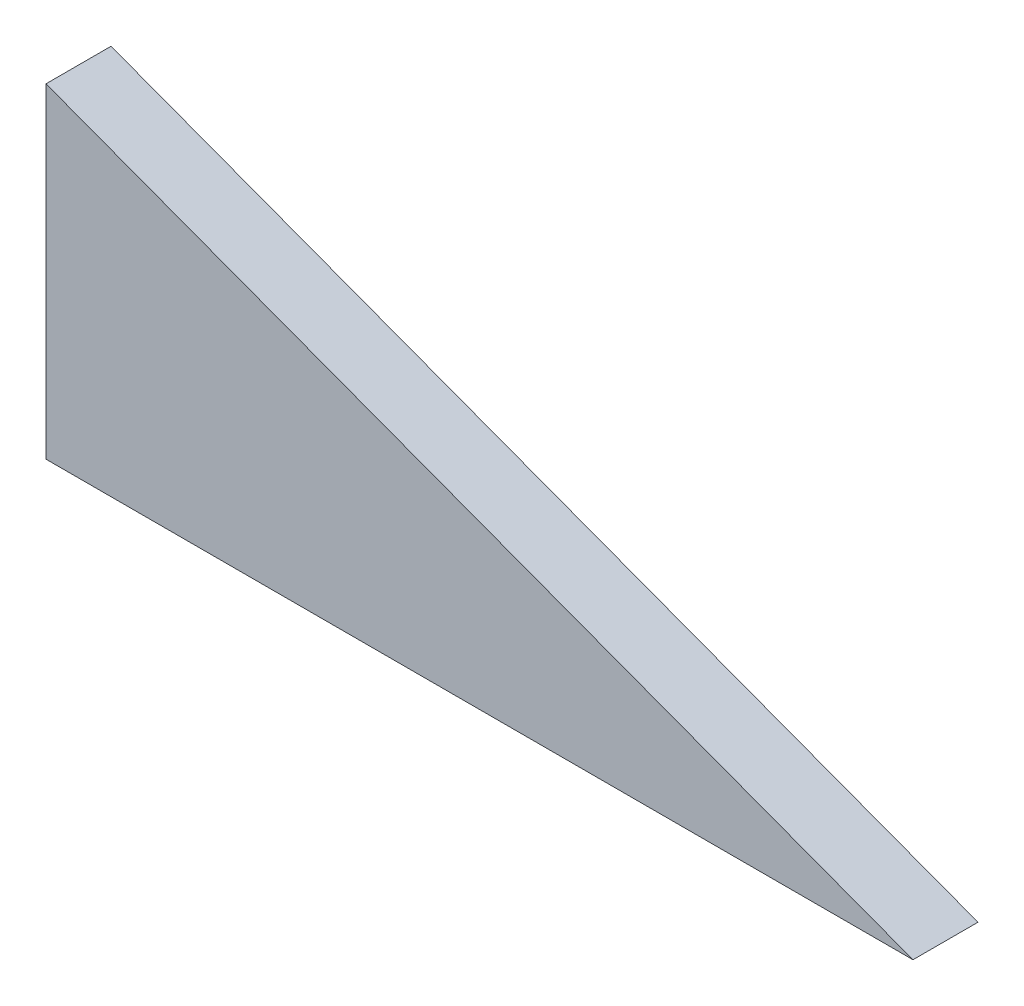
ISO-10303-21;
HEADER;
FILE_DESCRIPTION(('STEP AP214'),'2;1');
FILE_NAME('part.step','',(''),(''),'','','');
FILE_SCHEMA(('AUTOMOTIVE_DESIGN { 1 0 10303 214 1 1 1 1 }'));
ENDSEC;
DATA;
#1=APPLICATION_CONTEXT('core data for automotive mechanical design processes');
#2=APPLICATION_PROTOCOL_DEFINITION('international standard','automotive_design',2000,#1);
#3=PRODUCT_CONTEXT('',#1,'mechanical');
#4=PRODUCT('Part','Part','',(#3));
#5=PRODUCT_RELATED_PRODUCT_CATEGORY('part','',(#4));
#6=PRODUCT_DEFINITION_FORMATION('','',#4);
#7=PRODUCT_DEFINITION_CONTEXT('part definition',#1,'design');
#8=PRODUCT_DEFINITION('design','',#6,#7);
#9=PRODUCT_DEFINITION_SHAPE('','',#8);
#10=(LENGTH_UNIT() NAMED_UNIT(*) SI_UNIT(.MILLI.,.METRE.));
#11=(NAMED_UNIT(*) PLANE_ANGLE_UNIT() SI_UNIT($,.RADIAN.));
#12=(NAMED_UNIT(*) SI_UNIT($,.STERADIAN.) SOLID_ANGLE_UNIT());
#13=UNCERTAINTY_MEASURE_WITH_UNIT(LENGTH_MEASURE(1.E-05),#10,'distance_accuracy_value','');
#14=(GEOMETRIC_REPRESENTATION_CONTEXT(3) GLOBAL_UNCERTAINTY_ASSIGNED_CONTEXT((#13)) GLOBAL_UNIT_ASSIGNED_CONTEXT((#10,
#11,#12)) REPRESENTATION_CONTEXT('',''));
#15=CARTESIAN_POINT('',(0.,0.,0.));
#16=DIRECTION('',(0.,0.,1.));
#17=DIRECTION('',(1.,0.,0.));
#18=AXIS2_PLACEMENT_3D('',#15,#16,#17);
#19=CARTESIAN_POINT('',(0.,0.,98.0226086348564));
#20=DIRECTION('',(0.,0.,1.));
#21=DIRECTION('',(1.,0.,0.));
#22=AXIS2_PLACEMENT_3D('',#19,#20,#21);
#23=PLANE('',#22);
#24=DIRECTION('',(1.,0.,0.));
#25=VECTOR('',#24,1.);
#26=CARTESIAN_POINT('',(542.609898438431,5.,98.0226086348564));
#27=LINE('',#26,#25);
#28=CARTESIAN_POINT('',(542.609898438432,4.99999999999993,98.0226086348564));
#29=VERTEX_POINT('',#28);
#30=CARTESIAN_POINT('',(502.609898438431,5.,98.0226086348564));
#31=VERTEX_POINT('',#30);
#32=EDGE_CURVE('E20',#29,#31,#27,.F.);
#33=ORIENTED_EDGE('',*,*,#32,.F.);
#34=DIRECTION('',(-0.936329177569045,0.351123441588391,0.));
#35=VECTOR('',#34,1.);
#36=CARTESIAN_POINT('',(502.609898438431,20.,98.0226086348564));
#37=LINE('',#36,#35);
#38=CARTESIAN_POINT('',(502.609898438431,20.,98.0226086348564));
#39=VERTEX_POINT('',#38);
#40=EDGE_CURVE('E57',#39,#29,#37,.F.);
#41=ORIENTED_EDGE('',*,*,#40,.F.);
#42=DIRECTION('',(0.,1.,0.));
#43=VECTOR('',#42,1.);
#44=CARTESIAN_POINT('',(502.609898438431,5.,98.0226086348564));
#45=LINE('',#44,#43);
#46=EDGE_CURVE('E47',#31,#39,#45,.T.);
#47=ORIENTED_EDGE('',*,*,#46,.F.);
#48=EDGE_LOOP('',(#33,#41,#47));
#49=FACE_BOUND('',#48,.T.);
#50=ADVANCED_FACE('F17',(#49),#23,.T.);
#51=CARTESIAN_POINT('',(542.609898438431,5.,95.0226086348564));
#52=DIRECTION('',(0.,-1.,0.));
#53=DIRECTION('',(0.,0.,-1.));
#54=AXIS2_PLACEMENT_3D('',#51,#52,#53);
#55=PLANE('',#54);
#56=DIRECTION('',(1.,0.,0.));
#57=VECTOR('',#56,1.);
#58=CARTESIAN_POINT('',(0.,5.,95.0226086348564));
#59=LINE('',#58,#57);
#60=CARTESIAN_POINT('',(502.609898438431,5.,95.0226086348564));
#61=VERTEX_POINT('',#60);
#62=CARTESIAN_POINT('',(542.609898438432,4.99999999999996,95.0226086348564));
#63=VERTEX_POINT('',#62);
#64=EDGE_CURVE('E64',#61,#63,#59,.T.);
#65=ORIENTED_EDGE('',*,*,#64,.T.);
#66=DIRECTION('',(0.,0.,1.));
#67=VECTOR('',#66,1.);
#68=CARTESIAN_POINT('',(542.609898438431,5.,95.0226086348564));
#69=LINE('',#68,#67);
#70=EDGE_CURVE('E54',#29,#63,#69,.F.);
#71=ORIENTED_EDGE('',*,*,#70,.F.);
#72=ORIENTED_EDGE('',*,*,#32,.T.);
#73=DIRECTION('',(0.,0.,1.));
#74=VECTOR('',#73,1.);
#75=CARTESIAN_POINT('',(502.609898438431,5.,95.0226086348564));
#76=LINE('',#75,#74);
#77=EDGE_CURVE('E51',#61,#31,#76,.T.);
#78=ORIENTED_EDGE('',*,*,#77,.F.);
#79=EDGE_LOOP('',(#65,#71,#72,#78));
#80=FACE_BOUND('',#79,.T.);
#81=ADVANCED_FACE('F73',(#80),#55,.T.);
#82=CARTESIAN_POINT('',(502.609898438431,20.,95.0226086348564));
#83=DIRECTION('',(0.351123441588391,0.936329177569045,0.));
#84=DIRECTION('',(-0.936329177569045,0.351123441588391,0.));
#85=AXIS2_PLACEMENT_3D('',#82,#83,#84);
#86=PLANE('',#85);
#87=DIRECTION('',(-0.936329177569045,0.351123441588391,0.));
#88=VECTOR('',#87,1.);
#89=CARTESIAN_POINT('',(542.609898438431,5.,95.0226086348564));
#90=LINE('',#89,#88);
#91=CARTESIAN_POINT('',(502.609898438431,20.,95.0226086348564));
#92=VERTEX_POINT('',#91);
#93=EDGE_CURVE('E26',#63,#92,#90,.T.);
#94=ORIENTED_EDGE('',*,*,#93,.T.);
#95=DIRECTION('',(0.,0.,1.));
#96=VECTOR('',#95,1.);
#97=CARTESIAN_POINT('',(502.609898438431,20.,95.0226086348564));
#98=LINE('',#97,#96);
#99=EDGE_CURVE('E34',#39,#92,#98,.F.);
#100=ORIENTED_EDGE('',*,*,#99,.F.);
#101=ORIENTED_EDGE('',*,*,#40,.T.);
#102=ORIENTED_EDGE('',*,*,#70,.T.);
#103=EDGE_LOOP('',(#94,#100,#101,#102));
#104=FACE_BOUND('',#103,.T.);
#105=ADVANCED_FACE('F61',(#104),#86,.T.);
#106=CARTESIAN_POINT('',(502.609898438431,5.,95.0226086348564));
#107=DIRECTION('',(-1.,0.,0.));
#108=DIRECTION('',(0.,0.,1.));
#109=AXIS2_PLACEMENT_3D('',#106,#107,#108);
#110=PLANE('',#109);
#111=DIRECTION('',(0.,1.,0.));
#112=VECTOR('',#111,1.);
#113=CARTESIAN_POINT('',(502.609898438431,0.,95.0226086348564));
#114=LINE('',#113,#112);
#115=EDGE_CURVE('E11',#92,#61,#114,.F.);
#116=ORIENTED_EDGE('',*,*,#115,.T.);
#117=ORIENTED_EDGE('',*,*,#77,.T.);
#118=ORIENTED_EDGE('',*,*,#46,.T.);
#119=ORIENTED_EDGE('',*,*,#99,.T.);
#120=EDGE_LOOP('',(#116,#117,#118,#119));
#121=FACE_BOUND('',#120,.T.);
#122=ADVANCED_FACE('F49',(#121),#110,.T.);
#123=CARTESIAN_POINT('',(0.,0.,95.0226086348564));
#124=DIRECTION('',(0.,0.,1.));
#125=DIRECTION('',(1.,0.,0.));
#126=AXIS2_PLACEMENT_3D('',#123,#124,#125);
#127=PLANE('',#126);
#128=ORIENTED_EDGE('',*,*,#93,.F.);
#129=ORIENTED_EDGE('',*,*,#64,.F.);
#130=ORIENTED_EDGE('',*,*,#115,.F.);
#131=EDGE_LOOP('',(#128,#129,#130));
#132=FACE_BOUND('',#131,.T.);
#133=ADVANCED_FACE('F71',(#132),#127,.F.);
#134=CLOSED_SHELL('',(#50,#81,#105,#122,#133));
#135=MANIFOLD_SOLID_BREP('B1',#134);
#136=ADVANCED_BREP_SHAPE_REPRESENTATION('',(#18,#135),#14);
#137=SHAPE_DEFINITION_REPRESENTATION(#9,#136);
ENDSEC;
END-ISO-10303-21;
